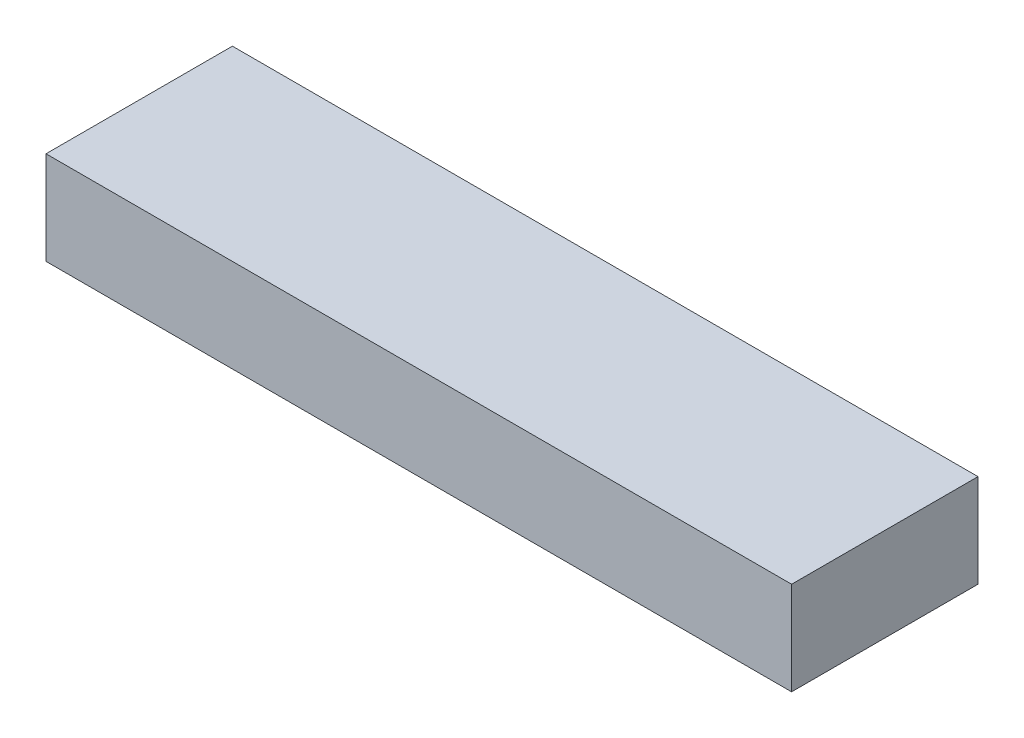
from build123d import *

# Parameters (mm, degrees)
ESQUISSE1_W        = 30
ESQUISSE1_H        = 15
BOSS_EXTRU_1_DEPTH = 120


with BuildPart() as part:
    # Esquisse1 → Boss.-Extru.1 (new body)
    with BuildSketch(Plane(origin=(0, 0, 0), x_dir=(0, 0, -1), z_dir=(1, 0, 0))):
        with Locations((15, 7.5)):
            Rectangle(ESQUISSE1_W, ESQUISSE1_H)
    extrude(amount=BOSS_EXTRU_1_DEPTH)


solid = part.part
